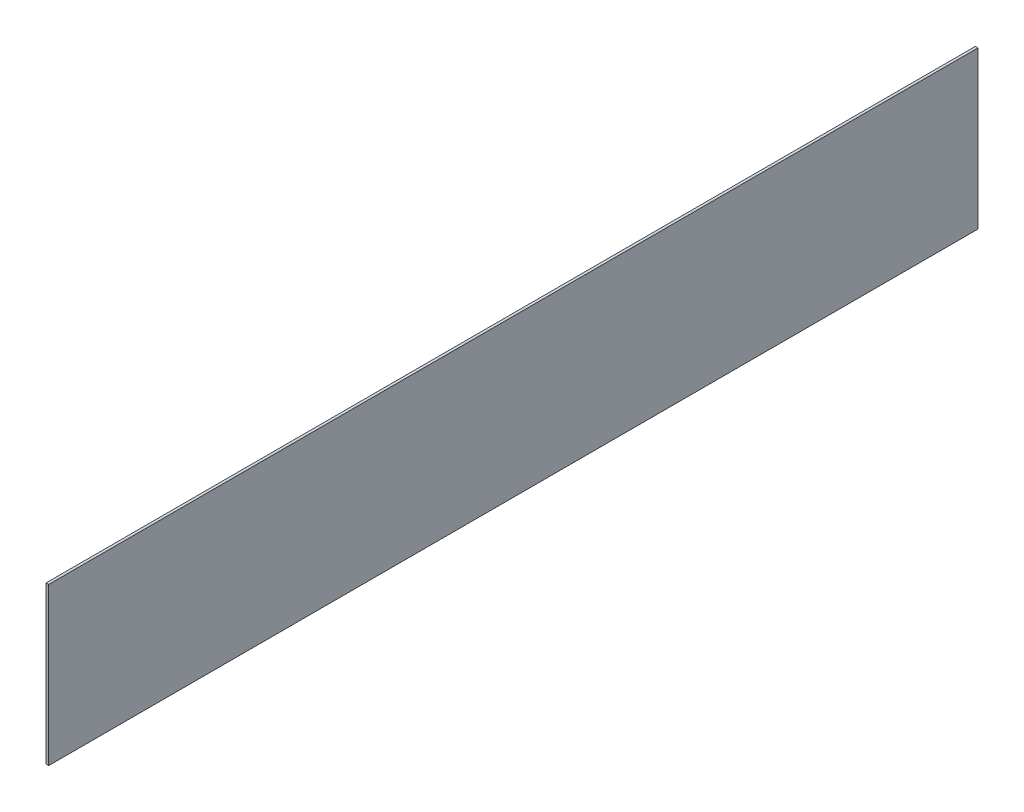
ISO-10303-21;
HEADER;
FILE_DESCRIPTION(('STEP AP214'),'2;1');
FILE_NAME('part.step','',(''),(''),'','','');
FILE_SCHEMA(('AUTOMOTIVE_DESIGN { 1 0 10303 214 1 1 1 1 }'));
ENDSEC;
DATA;
#1=APPLICATION_CONTEXT('core data for automotive mechanical design processes');
#2=APPLICATION_PROTOCOL_DEFINITION('international standard','automotive_design',2000,#1);
#3=PRODUCT_CONTEXT('',#1,'mechanical');
#4=PRODUCT('Part','Part','',(#3));
#5=PRODUCT_RELATED_PRODUCT_CATEGORY('part','',(#4));
#6=PRODUCT_DEFINITION_FORMATION('','',#4);
#7=PRODUCT_DEFINITION_CONTEXT('part definition',#1,'design');
#8=PRODUCT_DEFINITION('design','',#6,#7);
#9=PRODUCT_DEFINITION_SHAPE('','',#8);
#10=(LENGTH_UNIT() NAMED_UNIT(*) SI_UNIT(.MILLI.,.METRE.));
#11=(NAMED_UNIT(*) PLANE_ANGLE_UNIT() SI_UNIT($,.RADIAN.));
#12=(NAMED_UNIT(*) SI_UNIT($,.STERADIAN.) SOLID_ANGLE_UNIT());
#13=UNCERTAINTY_MEASURE_WITH_UNIT(LENGTH_MEASURE(1.E-05),#10,'distance_accuracy_value','');
#14=(GEOMETRIC_REPRESENTATION_CONTEXT(3) GLOBAL_UNCERTAINTY_ASSIGNED_CONTEXT((#13)) GLOBAL_UNIT_ASSIGNED_CONTEXT((#10,
#11,#12)) REPRESENTATION_CONTEXT('',''));
#15=CARTESIAN_POINT('',(0.,0.,0.));
#16=DIRECTION('',(0.,0.,1.));
#17=DIRECTION('',(1.,0.,0.));
#18=AXIS2_PLACEMENT_3D('',#15,#16,#17);
#19=CARTESIAN_POINT('',(-5.56,-10.46704180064,17.19421221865));
#20=DIRECTION('',(-1.,0.,0.));
#21=DIRECTION('',(0.,-1.,0.));
#22=AXIS2_PLACEMENT_3D('',#19,#20,#21);
#23=PLANE('',#22);
#24=DIRECTION('',(0.,1.,0.));
#25=VECTOR('',#24,1.);
#26=CARTESIAN_POINT('',(-5.56,-10.17122186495,20.699035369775));
#27=LINE('',#26,#25);
#28=CARTESIAN_POINT('',(-5.56,-10.17122186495,20.699035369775));
#29=VERTEX_POINT('',#28);
#30=CARTESIAN_POINT('',(-5.56,-10.76286173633,20.699035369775));
#31=VERTEX_POINT('',#30);
#32=EDGE_CURVE('E58',#29,#31,#27,.F.);
#33=ORIENTED_EDGE('',*,*,#32,.F.);
#34=DIRECTION('',(0.,0.,1.));
#35=VECTOR('',#34,1.);
#36=CARTESIAN_POINT('',(-5.56,-10.17122186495,17.19421221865));
#37=LINE('',#36,#35);
#38=CARTESIAN_POINT('',(-5.56,-10.17122186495,17.19421221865));
#39=VERTEX_POINT('',#38);
#40=EDGE_CURVE('E53',#39,#29,#37,.T.);
#41=ORIENTED_EDGE('',*,*,#40,.F.);
#42=DIRECTION('',(0.,-1.,0.));
#43=VECTOR('',#42,1.);
#44=CARTESIAN_POINT('',(-5.56,-10.46704180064,17.19421221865));
#45=LINE('',#44,#43);
#46=CARTESIAN_POINT('',(-5.56,-10.76286173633,17.19421221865));
#47=VERTEX_POINT('',#46);
#48=EDGE_CURVE('E20',#39,#47,#45,.T.);
#49=ORIENTED_EDGE('',*,*,#48,.T.);
#50=DIRECTION('',(0.,0.,1.));
#51=VECTOR('',#50,1.);
#52=CARTESIAN_POINT('',(-5.56,-10.76286173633,20.699035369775));
#53=LINE('',#52,#51);
#54=EDGE_CURVE('E67',#31,#47,#53,.F.);
#55=ORIENTED_EDGE('',*,*,#54,.F.);
#56=EDGE_LOOP('',(#33,#41,#49,#55));
#57=FACE_BOUND('',#56,.T.);
#58=ADVANCED_FACE('F17',(#57),#23,.T.);
#59=CARTESIAN_POINT('',(-5.56,-10.76286173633,20.699035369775));
#60=DIRECTION('',(0.,-1.,0.));
#61=DIRECTION('',(1.,0.,0.));
#62=AXIS2_PLACEMENT_3D('',#59,#60,#61);
#63=PLANE('',#62);
#64=ORIENTED_EDGE('',*,*,#54,.T.);
#65=DIRECTION('',(-1.,0.,0.));
#66=VECTOR('',#65,1.);
#67=CARTESIAN_POINT('',(-5.56,-10.76286173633,17.19421221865));
#68=LINE('',#67,#66);
#69=CARTESIAN_POINT('',(-5.55,-10.76286173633,17.19421221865));
#70=VERTEX_POINT('',#69);
#71=EDGE_CURVE('E80',#70,#47,#68,.T.);
#72=ORIENTED_EDGE('',*,*,#71,.F.);
#73=DIRECTION('',(0.,0.,1.));
#74=VECTOR('',#73,1.);
#75=CARTESIAN_POINT('',(-5.55,-10.76286173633,17.19421221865));
#76=LINE('',#75,#74);
#77=CARTESIAN_POINT('',(-5.55,-10.76286173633,20.699035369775));
#78=VERTEX_POINT('',#77);
#79=EDGE_CURVE('E75',#70,#78,#76,.T.);
#80=ORIENTED_EDGE('',*,*,#79,.T.);
#81=DIRECTION('',(1.,0.,0.));
#82=VECTOR('',#81,1.);
#83=CARTESIAN_POINT('',(-5.56,-10.76286173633,20.699035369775));
#84=LINE('',#83,#82);
#85=EDGE_CURVE('E63',#31,#78,#84,.T.);
#86=ORIENTED_EDGE('',*,*,#85,.F.);
#87=EDGE_LOOP('',(#64,#72,#80,#86));
#88=FACE_BOUND('',#87,.T.);
#89=ADVANCED_FACE('F74',(#88),#63,.T.);
#90=CARTESIAN_POINT('',(-5.56,-10.17122186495,20.699035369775));
#91=DIRECTION('',(0.,0.,1.));
#92=DIRECTION('',(1.,0.,0.));
#93=AXIS2_PLACEMENT_3D('',#90,#91,#92);
#94=PLANE('',#93);
#95=ORIENTED_EDGE('',*,*,#32,.T.);
#96=ORIENTED_EDGE('',*,*,#85,.T.);
#97=DIRECTION('',(0.,-1.,0.));
#98=VECTOR('',#97,1.);
#99=CARTESIAN_POINT('',(-5.55,-10.46704180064,20.699035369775));
#100=LINE('',#99,#98);
#101=CARTESIAN_POINT('',(-5.55,-10.17122186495,20.699035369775));
#102=VERTEX_POINT('',#101);
#103=EDGE_CURVE('E84',#78,#102,#100,.F.);
#104=ORIENTED_EDGE('',*,*,#103,.T.);
#105=DIRECTION('',(-1.,0.,0.));
#106=VECTOR('',#105,1.);
#107=CARTESIAN_POINT('',(-5.56,-10.17122186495,20.699035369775));
#108=LINE('',#107,#106);
#109=EDGE_CURVE('E65',#29,#102,#108,.F.);
#110=ORIENTED_EDGE('',*,*,#109,.F.);
#111=EDGE_LOOP('',(#95,#96,#104,#110));
#112=FACE_BOUND('',#111,.T.);
#113=ADVANCED_FACE('F60',(#112),#94,.T.);
#114=CARTESIAN_POINT('',(-5.56,-10.17122186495,17.19421221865));
#115=DIRECTION('',(0.,1.,0.));
#116=DIRECTION('',(-1.,0.,0.));
#117=AXIS2_PLACEMENT_3D('',#114,#115,#116);
#118=PLANE('',#117);
#119=ORIENTED_EDGE('',*,*,#40,.T.);
#120=ORIENTED_EDGE('',*,*,#109,.T.);
#121=DIRECTION('',(0.,0.,1.));
#122=VECTOR('',#121,1.);
#123=CARTESIAN_POINT('',(-5.55,-10.17122186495,17.19421221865));
#124=LINE('',#123,#122);
#125=CARTESIAN_POINT('',(-5.55,-10.17122186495,17.19421221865));
#126=VERTEX_POINT('',#125);
#127=EDGE_CURVE('E26',#102,#126,#124,.F.);
#128=ORIENTED_EDGE('',*,*,#127,.T.);
#129=DIRECTION('',(-1.,0.,0.));
#130=VECTOR('',#129,1.);
#131=CARTESIAN_POINT('',(-5.56,-10.17122186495,17.19421221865));
#132=LINE('',#131,#130);
#133=EDGE_CURVE('E34',#39,#126,#132,.F.);
#134=ORIENTED_EDGE('',*,*,#133,.F.);
#135=EDGE_LOOP('',(#119,#120,#128,#134));
#136=FACE_BOUND('',#135,.T.);
#137=ADVANCED_FACE('F88',(#136),#118,.T.);
#138=CARTESIAN_POINT('',(-5.56,-10.76286173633,17.19421221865));
#139=DIRECTION('',(0.,0.,-1.));
#140=DIRECTION('',(-1.,0.,0.));
#141=AXIS2_PLACEMENT_3D('',#138,#139,#140);
#142=PLANE('',#141);
#143=ORIENTED_EDGE('',*,*,#48,.F.);
#144=ORIENTED_EDGE('',*,*,#133,.T.);
#145=DIRECTION('',(0.,-1.,0.));
#146=VECTOR('',#145,1.);
#147=CARTESIAN_POINT('',(-5.55,-10.46704180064,17.19421221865));
#148=LINE('',#147,#146);
#149=EDGE_CURVE('E11',#126,#70,#148,.T.);
#150=ORIENTED_EDGE('',*,*,#149,.T.);
#151=ORIENTED_EDGE('',*,*,#71,.T.);
#152=EDGE_LOOP('',(#143,#144,#150,#151));
#153=FACE_BOUND('',#152,.T.);
#154=ADVANCED_FACE('F91',(#153),#142,.T.);
#155=CARTESIAN_POINT('',(-5.55,-10.46704180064,17.19421221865));
#156=DIRECTION('',(-1.,0.,0.));
#157=DIRECTION('',(0.,-1.,0.));
#158=AXIS2_PLACEMENT_3D('',#155,#156,#157);
#159=PLANE('',#158);
#160=ORIENTED_EDGE('',*,*,#127,.F.);
#161=ORIENTED_EDGE('',*,*,#103,.F.);
#162=ORIENTED_EDGE('',*,*,#79,.F.);
#163=ORIENTED_EDGE('',*,*,#149,.F.);
#164=EDGE_LOOP('',(#160,#161,#162,#163));
#165=FACE_BOUND('',#164,.T.);
#166=ADVANCED_FACE('F90',(#165),#159,.F.);
#167=CLOSED_SHELL('',(#58,#89,#113,#137,#154,#166));
#168=MANIFOLD_SOLID_BREP('B1',#167);
#169=ADVANCED_BREP_SHAPE_REPRESENTATION('',(#18,#168),#14);
#170=SHAPE_DEFINITION_REPRESENTATION(#9,#169);
ENDSEC;
END-ISO-10303-21;
